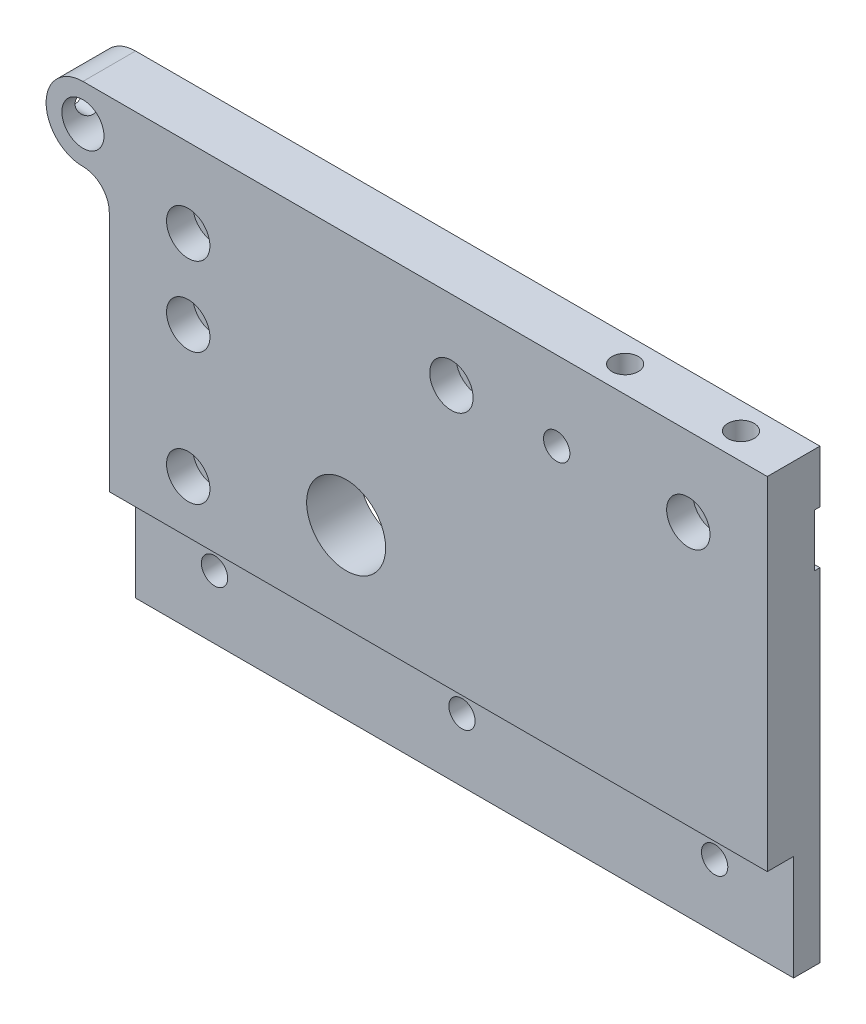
ISO-10303-21;
HEADER;
FILE_DESCRIPTION(('STEP AP214'),'2;1');
FILE_NAME('part.step','',(''),(''),'','','');
FILE_SCHEMA(('AUTOMOTIVE_DESIGN { 1 0 10303 214 1 1 1 1 }'));
ENDSEC;
DATA;
#1=APPLICATION_CONTEXT('core data for automotive mechanical design processes');
#2=APPLICATION_PROTOCOL_DEFINITION('international standard','automotive_design',2000,#1);
#3=PRODUCT_CONTEXT('',#1,'mechanical');
#4=PRODUCT('Part','Part','',(#3));
#5=PRODUCT_RELATED_PRODUCT_CATEGORY('part','',(#4));
#6=PRODUCT_DEFINITION_FORMATION('','',#4);
#7=PRODUCT_DEFINITION_CONTEXT('part definition',#1,'design');
#8=PRODUCT_DEFINITION('design','',#6,#7);
#9=PRODUCT_DEFINITION_SHAPE('','',#8);
#10=(LENGTH_UNIT() NAMED_UNIT(*) SI_UNIT(.MILLI.,.METRE.));
#11=(NAMED_UNIT(*) PLANE_ANGLE_UNIT() SI_UNIT($,.RADIAN.));
#12=(NAMED_UNIT(*) SI_UNIT($,.STERADIAN.) SOLID_ANGLE_UNIT());
#13=UNCERTAINTY_MEASURE_WITH_UNIT(LENGTH_MEASURE(1.E-05),#10,'distance_accuracy_value','');
#14=(GEOMETRIC_REPRESENTATION_CONTEXT(3) GLOBAL_UNCERTAINTY_ASSIGNED_CONTEXT((#13)) GLOBAL_UNIT_ASSIGNED_CONTEXT((#10,
#11,#12)) REPRESENTATION_CONTEXT('',''));
#15=CARTESIAN_POINT('',(0.,0.,0.));
#16=DIRECTION('',(0.,0.,1.));
#17=DIRECTION('',(1.,0.,0.));
#18=AXIS2_PLACEMENT_3D('',#15,#16,#17);
#19=CARTESIAN_POINT('',(60.325,34.925,6.35));
#20=DIRECTION('',(0.,0.,1.));
#21=DIRECTION('',(1.,0.,0.));
#22=AXIS2_PLACEMENT_3D('',#19,#20,#21);
#23=CYLINDRICAL_SURFACE('',#22,3.3782);
#24=CARTESIAN_POINT('',(60.325,34.925,0.));
#25=DIRECTION('',(0.,0.,1.));
#26=DIRECTION('',(1.,0.,0.));
#27=AXIS2_PLACEMENT_3D('',#24,#25,#26);
#28=CIRCLE('',#27,3.37820000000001);
#29=CARTESIAN_POINT('',(63.7032,34.925,0.));
#30=VERTEX_POINT('',#29);
#31=EDGE_CURVE('E219',#30,#30,#28,.T.);
#32=ORIENTED_EDGE('',*,*,#31,.T.);
#33=EDGE_LOOP('',(#32));
#34=FACE_BOUND('',#33,.T.);
#35=CARTESIAN_POINT('',(60.325,34.925,-5.08));
#36=DIRECTION('',(0.,0.,-1.));
#37=DIRECTION('',(-1.,0.,0.));
#38=AXIS2_PLACEMENT_3D('',#35,#36,#37);
#39=CIRCLE('',#38,3.3782);
#40=CARTESIAN_POINT('',(56.9468,34.925,-5.08));
#41=VERTEX_POINT('',#40);
#42=EDGE_CURVE('E165',#41,#41,#39,.F.);
#43=ORIENTED_EDGE('',*,*,#42,.F.);
#44=EDGE_LOOP('',(#43));
#45=FACE_BOUND('',#44,.T.);
#46=ADVANCED_FACE('F35',(#34,#45),#23,.F.);
#47=CARTESIAN_POINT('',(3.175,34.925,6.35));
#48=DIRECTION('',(0.,0.,1.));
#49=DIRECTION('',(1.,0.,0.));
#50=AXIS2_PLACEMENT_3D('',#47,#48,#49);
#51=CYLINDRICAL_SURFACE('',#50,3.3782);
#52=CARTESIAN_POINT('',(3.175,34.925,0.));
#53=DIRECTION('',(0.,0.,1.));
#54=DIRECTION('',(1.,0.,0.));
#55=AXIS2_PLACEMENT_3D('',#52,#53,#54);
#56=CIRCLE('',#55,3.37820000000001);
#57=CARTESIAN_POINT('',(6.55320000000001,34.925,0.));
#58=VERTEX_POINT('',#57);
#59=EDGE_CURVE('E210',#58,#58,#56,.T.);
#60=ORIENTED_EDGE('',*,*,#59,.T.);
#61=EDGE_LOOP('',(#60));
#62=FACE_BOUND('',#61,.T.);
#63=CARTESIAN_POINT('',(3.175,34.925,-5.08));
#64=DIRECTION('',(0.,0.,-1.));
#65=DIRECTION('',(-1.,0.,0.));
#66=AXIS2_PLACEMENT_3D('',#63,#64,#65);
#67=CIRCLE('',#66,3.3782);
#68=CARTESIAN_POINT('',(-0.203200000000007,34.925,-5.08));
#69=VERTEX_POINT('',#68);
#70=EDGE_CURVE('E161',#69,#69,#67,.F.);
#71=ORIENTED_EDGE('',*,*,#70,.F.);
#72=EDGE_LOOP('',(#71));
#73=FACE_BOUND('',#72,.T.);
#74=ADVANCED_FACE('F415',(#62,#73),#51,.F.);
#75=CARTESIAN_POINT('',(-60.325,34.925,6.35));
#76=DIRECTION('',(0.,0.,1.));
#77=DIRECTION('',(1.,0.,0.));
#78=AXIS2_PLACEMENT_3D('',#75,#76,#77);
#79=CYLINDRICAL_SURFACE('',#78,3.3782);
#80=CARTESIAN_POINT('',(-60.325,34.925,0.));
#81=DIRECTION('',(0.,0.,1.));
#82=DIRECTION('',(1.,0.,0.));
#83=AXIS2_PLACEMENT_3D('',#80,#81,#82);
#84=CIRCLE('',#83,3.37820000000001);
#85=CARTESIAN_POINT('',(-56.9468,34.925,0.));
#86=VERTEX_POINT('',#85);
#87=EDGE_CURVE('E201',#86,#86,#84,.T.);
#88=ORIENTED_EDGE('',*,*,#87,.T.);
#89=EDGE_LOOP('',(#88));
#90=FACE_BOUND('',#89,.T.);
#91=CARTESIAN_POINT('',(-60.325,34.925,-5.08));
#92=DIRECTION('',(0.,0.,-1.));
#93=DIRECTION('',(-1.,0.,0.));
#94=AXIS2_PLACEMENT_3D('',#91,#92,#93);
#95=CIRCLE('',#94,3.3782);
#96=CARTESIAN_POINT('',(-63.7032,34.925,-5.08));
#97=VERTEX_POINT('',#96);
#98=EDGE_CURVE('E158',#97,#97,#95,.F.);
#99=ORIENTED_EDGE('',*,*,#98,.F.);
#100=EDGE_LOOP('',(#99));
#101=FACE_BOUND('',#100,.T.);
#102=ADVANCED_FACE('F379',(#90,#101),#79,.F.);
#103=CARTESIAN_POINT('',(28.575,34.925,-15.748));
#104=DIRECTION('',(0.,0.,1.));
#105=DIRECTION('',(1.,0.,0.));
#106=AXIS2_PLACEMENT_3D('',#103,#104,#105);
#107=CYLINDRICAL_SURFACE('',#106,3.175);
#108=CARTESIAN_POINT('',(28.575,34.925,6.35));
#109=DIRECTION('',(0.,0.,1.));
#110=DIRECTION('',(1.,0.,0.));
#111=AXIS2_PLACEMENT_3D('',#108,#109,#110);
#112=CIRCLE('',#111,3.175);
#113=CARTESIAN_POINT('',(31.75,34.925,6.35));
#114=VERTEX_POINT('',#113);
#115=EDGE_CURVE('E168',#114,#114,#112,.T.);
#116=ORIENTED_EDGE('',*,*,#115,.T.);
#117=EDGE_LOOP('',(#116));
#118=FACE_BOUND('',#117,.T.);
#119=CARTESIAN_POINT('',(28.575,34.925,-5.08));
#120=DIRECTION('',(0.,0.,-1.));
#121=DIRECTION('',(-1.,0.,0.));
#122=AXIS2_PLACEMENT_3D('',#119,#120,#121);
#123=CIRCLE('',#122,3.175);
#124=CARTESIAN_POINT('',(25.4,34.925,-5.08));
#125=VERTEX_POINT('',#124);
#126=EDGE_CURVE('E162',#125,#125,#123,.F.);
#127=ORIENTED_EDGE('',*,*,#126,.F.);
#128=EDGE_LOOP('',(#127));
#129=FACE_BOUND('',#128,.T.);
#130=ADVANCED_FACE('F375',(#118,#129),#107,.F.);
#131=CARTESIAN_POINT('',(-85.7249999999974,29.845,6.35));
#132=DIRECTION('',(0.,0.,1.));
#133=DIRECTION('',(1.,0.,0.));
#134=AXIS2_PLACEMENT_3D('',#131,#132,#133);
#135=PLANE('',#134);
#136=ORIENTED_EDGE('',*,*,#115,.F.);
#137=EDGE_LOOP('',(#136));
#138=FACE_BOUND('',#137,.T.);
#139=CARTESIAN_POINT('',(-60.325,-15.875,6.35));
#140=DIRECTION('',(0.,0.,1.));
#141=DIRECTION('',(1.,0.,0.));
#142=AXIS2_PLACEMENT_3D('',#139,#140,#141);
#143=CIRCLE('',#142,5.2324);
#144=CARTESIAN_POINT('',(-55.0926,-15.875,6.35));
#145=VERTEX_POINT('',#144);
#146=EDGE_CURVE('E171',#145,#145,#143,.T.);
#147=ORIENTED_EDGE('',*,*,#146,.F.);
#148=EDGE_LOOP('',(#147));
#149=FACE_BOUND('',#148,.T.);
#150=CARTESIAN_POINT('',(-60.325,15.875,6.35));
#151=DIRECTION('',(0.,0.,1.));
#152=DIRECTION('',(1.,0.,0.));
#153=AXIS2_PLACEMENT_3D('',#150,#151,#152);
#154=CIRCLE('',#153,5.2324);
#155=CARTESIAN_POINT('',(-55.0926,15.875,6.35));
#156=VERTEX_POINT('',#155);
#157=EDGE_CURVE('E183',#156,#156,#154,.T.);
#158=ORIENTED_EDGE('',*,*,#157,.F.);
#159=EDGE_LOOP('',(#158));
#160=FACE_BOUND('',#159,.T.);
#161=CARTESIAN_POINT('',(-60.325,34.925,6.35));
#162=DIRECTION('',(0.,0.,1.));
#163=DIRECTION('',(1.,0.,0.));
#164=AXIS2_PLACEMENT_3D('',#161,#162,#163);
#165=CIRCLE('',#164,5.2324);
#166=CARTESIAN_POINT('',(-55.0926,34.925,6.35));
#167=VERTEX_POINT('',#166);
#168=EDGE_CURVE('E195',#167,#167,#165,.T.);
#169=ORIENTED_EDGE('',*,*,#168,.F.);
#170=EDGE_LOOP('',(#169));
#171=FACE_BOUND('',#170,.T.);
#172=CARTESIAN_POINT('',(3.175,34.925,6.35));
#173=DIRECTION('',(0.,0.,1.));
#174=DIRECTION('',(1.,0.,0.));
#175=AXIS2_PLACEMENT_3D('',#172,#173,#174);
#176=CIRCLE('',#175,5.23239999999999);
#177=CARTESIAN_POINT('',(8.40739999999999,34.925,6.35));
#178=VERTEX_POINT('',#177);
#179=EDGE_CURVE('E204',#178,#178,#176,.T.);
#180=ORIENTED_EDGE('',*,*,#179,.F.);
#181=EDGE_LOOP('',(#180));
#182=FACE_BOUND('',#181,.T.);
#183=CARTESIAN_POINT('',(60.325,34.925,6.35));
#184=DIRECTION('',(0.,0.,1.));
#185=DIRECTION('',(1.,0.,0.));
#186=AXIS2_PLACEMENT_3D('',#183,#184,#185);
#187=CIRCLE('',#186,5.2324);
#188=CARTESIAN_POINT('',(65.5574,34.925,6.35));
#189=VERTEX_POINT('',#188);
#190=EDGE_CURVE('E213',#189,#189,#187,.T.);
#191=ORIENTED_EDGE('',*,*,#190,.F.);
#192=EDGE_LOOP('',(#191));
#193=FACE_BOUND('',#192,.T.);
#194=CARTESIAN_POINT('',(-85.7250000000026,45.085,6.35));
#195=DIRECTION('',(0.,0.,1.));
#196=DIRECTION('',(1.,0.,0.));
#197=AXIS2_PLACEMENT_3D('',#194,#195,#196);
#198=CIRCLE('',#197,5.08000000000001);
#199=CARTESIAN_POINT('',(-80.6450000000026,45.085,6.35));
#200=VERTEX_POINT('',#199);
#201=EDGE_CURVE('E258',#200,#200,#198,.T.);
#202=ORIENTED_EDGE('',*,*,#201,.F.);
#203=EDGE_LOOP('',(#202));
#204=FACE_BOUND('',#203,.T.);
#205=CARTESIAN_POINT('',(-22.2250000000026,-6.98499999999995,6.35));
#206=DIRECTION('',(0.,0.,1.));
#207=DIRECTION('',(1.,0.,0.));
#208=AXIS2_PLACEMENT_3D('',#205,#206,#207);
#209=CIRCLE('',#208,9.525);
#210=CARTESIAN_POINT('',(-12.7000000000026,-6.98499999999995,6.35));
#211=VERTEX_POINT('',#210);
#212=EDGE_CURVE('E252',#211,#211,#209,.T.);
#213=ORIENTED_EDGE('',*,*,#212,.F.);
#214=EDGE_LOOP('',(#213));
#215=FACE_BOUND('',#214,.T.);
#216=DIRECTION('',(0.,-1.,0.));
#217=VECTOR('',#216,1.);
#218=CARTESIAN_POINT('',(-79.3749999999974,29.845,6.35));
#219=LINE('',#218,#217);
#220=CARTESIAN_POINT('',(-79.3749999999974,29.845,6.35));
#221=VERTEX_POINT('',#220);
#222=CARTESIAN_POINT('',(-79.375,-28.575,6.35));
#223=VERTEX_POINT('',#222);
#224=EDGE_CURVE('E267',#221,#223,#219,.T.);
#225=ORIENTED_EDGE('',*,*,#224,.T.);
#226=DIRECTION('',(1.,0.,0.));
#227=VECTOR('',#226,1.);
#228=CARTESIAN_POINT('',(-85.7249999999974,-28.575,6.35));
#229=LINE('',#228,#227);
#230=CARTESIAN_POINT('',(79.375,-28.575,6.35));
#231=VERTEX_POINT('',#230);
#232=EDGE_CURVE('E239',#223,#231,#229,.T.);
#233=ORIENTED_EDGE('',*,*,#232,.T.);
#234=DIRECTION('',(0.,1.,0.));
#235=VECTOR('',#234,1.);
#236=CARTESIAN_POINT('',(79.375,53.975,6.35));
#237=LINE('',#236,#235);
#238=CARTESIAN_POINT('',(79.375,53.975,6.35));
#239=VERTEX_POINT('',#238);
#240=EDGE_CURVE('E271',#231,#239,#237,.T.);
#241=ORIENTED_EDGE('',*,*,#240,.T.);
#242=DIRECTION('',(-1.,0.,0.));
#243=VECTOR('',#242,1.);
#244=CARTESIAN_POINT('',(-85.7250000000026,53.975,6.35));
#245=LINE('',#244,#243);
#246=CARTESIAN_POINT('',(-85.7250000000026,53.975,6.35));
#247=VERTEX_POINT('',#246);
#248=EDGE_CURVE('E273',#239,#247,#245,.T.);
#249=ORIENTED_EDGE('',*,*,#248,.T.);
#250=CARTESIAN_POINT('',(-85.7250000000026,45.085,6.35));
#251=DIRECTION('',(0.,0.,1.));
#252=DIRECTION('',(1.,0.,0.));
#253=AXIS2_PLACEMENT_3D('',#250,#251,#252);
#254=CIRCLE('',#253,8.88999999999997);
#255=CARTESIAN_POINT('',(-85.7249999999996,36.1950000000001,6.35));
#256=VERTEX_POINT('',#255);
#257=EDGE_CURVE('E275',#247,#256,#254,.T.);
#258=ORIENTED_EDGE('',*,*,#257,.T.);
#259=CARTESIAN_POINT('',(-85.7249999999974,29.845,6.35));
#260=DIRECTION('',(0.,0.,-1.));
#261=DIRECTION('',(1.,0.,0.));
#262=AXIS2_PLACEMENT_3D('',#259,#260,#261);
#263=CIRCLE('',#262,6.34999999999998);
#264=EDGE_CURVE('E264',#256,#221,#263,.T.);
#265=ORIENTED_EDGE('',*,*,#264,.T.);
#266=EDGE_LOOP('',(#225,#233,#241,#249,#258,#265));
#267=FACE_BOUND('',#266,.T.);
#268=ADVANCED_FACE('F378',(#138,#149,#160,#171,#182,#193,#204,#215,#267),#135,.T.);
#269=CARTESIAN_POINT('',(-79.3749999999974,29.845,6.35));
#270=DIRECTION('',(1.,0.,0.));
#271=DIRECTION('',(0.,1.,0.));
#272=AXIS2_PLACEMENT_3D('',#269,#270,#271);
#273=PLANE('',#272);
#274=DIRECTION('',(0.,0.,-1.));
#275=VECTOR('',#274,1.);
#276=CARTESIAN_POINT('',(-79.375,-28.575,12.7));
#277=LINE('',#276,#275);
#278=CARTESIAN_POINT('',(-79.375,-28.575,0.));
#279=VERTEX_POINT('',#278);
#280=EDGE_CURVE('E230',#223,#279,#277,.T.);
#281=ORIENTED_EDGE('',*,*,#280,.F.);
#282=ORIENTED_EDGE('',*,*,#224,.F.);
#283=DIRECTION('',(0.,0.,-1.));
#284=VECTOR('',#283,1.);
#285=CARTESIAN_POINT('',(-79.3749999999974,29.845,6.35));
#286=LINE('',#285,#284);
#287=CARTESIAN_POINT('',(-79.3749999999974,29.845,-6.35));
#288=VERTEX_POINT('',#287);
#289=EDGE_CURVE('E48',#221,#288,#286,.T.);
#290=ORIENTED_EDGE('',*,*,#289,.T.);
#291=DIRECTION('',(0.,-1.,0.));
#292=VECTOR('',#291,1.);
#293=CARTESIAN_POINT('',(-79.3749999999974,29.845,-6.35));
#294=LINE('',#293,#292);
#295=CARTESIAN_POINT('',(-79.375,-53.975,-6.35));
#296=VERTEX_POINT('',#295);
#297=EDGE_CURVE('E280',#288,#296,#294,.T.);
#298=ORIENTED_EDGE('',*,*,#297,.T.);
#299=DIRECTION('',(0.,0.,-1.));
#300=VECTOR('',#299,1.);
#301=CARTESIAN_POINT('',(-79.375,-53.975,6.35));
#302=LINE('',#301,#300);
#303=CARTESIAN_POINT('',(-79.375,-53.975,0.));
#304=VERTEX_POINT('',#303);
#305=EDGE_CURVE('E301',#304,#296,#302,.T.);
#306=ORIENTED_EDGE('',*,*,#305,.F.);
#307=DIRECTION('',(0.,-1.,0.));
#308=VECTOR('',#307,1.);
#309=CARTESIAN_POINT('',(-79.375,-53.975,0.));
#310=LINE('',#309,#308);
#311=EDGE_CURVE('E222',#279,#304,#310,.T.);
#312=ORIENTED_EDGE('',*,*,#311,.F.);
#313=EDGE_LOOP('',(#281,#282,#290,#298,#306,#312));
#314=FACE_BOUND('',#313,.T.);
#315=ADVANCED_FACE('F467',(#314),#273,.F.);
#316=CARTESIAN_POINT('',(79.375,53.975,6.35));
#317=DIRECTION('',(-1.,0.,0.));
#318=DIRECTION('',(0.,0.,1.));
#319=AXIS2_PLACEMENT_3D('',#316,#317,#318);
#320=PLANE('',#319);
#321=DIRECTION('',(0.,-1.,0.));
#322=VECTOR('',#321,1.);
#323=CARTESIAN_POINT('',(79.375,41.275,-5.08));
#324=LINE('',#323,#322);
#325=CARTESIAN_POINT('',(79.375,41.275,-5.08));
#326=VERTEX_POINT('',#325);
#327=CARTESIAN_POINT('',(79.375,28.575,-5.08));
#328=VERTEX_POINT('',#327);
#329=EDGE_CURVE('E136',#326,#328,#324,.T.);
#330=ORIENTED_EDGE('',*,*,#329,.F.);
#331=DIRECTION('',(0.,0.,-1.));
#332=VECTOR('',#331,1.);
#333=CARTESIAN_POINT('',(79.375,41.275,-5.08));
#334=LINE('',#333,#332);
#335=CARTESIAN_POINT('',(79.375,41.275,-6.35));
#336=VERTEX_POINT('',#335);
#337=EDGE_CURVE('E307',#326,#336,#334,.T.);
#338=ORIENTED_EDGE('',*,*,#337,.T.);
#339=DIRECTION('',(0.,1.,0.));
#340=VECTOR('',#339,1.);
#341=CARTESIAN_POINT('',(79.375,53.975,-6.35));
#342=LINE('',#341,#340);
#343=CARTESIAN_POINT('',(79.375,53.975,-6.35));
#344=VERTEX_POINT('',#343);
#345=EDGE_CURVE('E286',#336,#344,#342,.T.);
#346=ORIENTED_EDGE('',*,*,#345,.T.);
#347=DIRECTION('',(0.,0.,-1.));
#348=VECTOR('',#347,1.);
#349=CARTESIAN_POINT('',(79.375,53.975,6.35));
#350=LINE('',#349,#348);
#351=EDGE_CURVE('E296',#239,#344,#350,.T.);
#352=ORIENTED_EDGE('',*,*,#351,.F.);
#353=ORIENTED_EDGE('',*,*,#240,.F.);
#354=DIRECTION('',(0.,0.,1.));
#355=VECTOR('',#354,1.);
#356=CARTESIAN_POINT('',(79.375,-28.575,6.35));
#357=LINE('',#356,#355);
#358=CARTESIAN_POINT('',(79.375,-28.575,0.));
#359=VERTEX_POINT('',#358);
#360=EDGE_CURVE('E11',#359,#231,#357,.T.);
#361=ORIENTED_EDGE('',*,*,#360,.F.);
#362=DIRECTION('',(0.,1.,0.));
#363=VECTOR('',#362,1.);
#364=CARTESIAN_POINT('',(79.375,-53.975,0.));
#365=LINE('',#364,#363);
#366=CARTESIAN_POINT('',(79.375,-53.975,0.));
#367=VERTEX_POINT('',#366);
#368=EDGE_CURVE('E225',#367,#359,#365,.T.);
#369=ORIENTED_EDGE('',*,*,#368,.F.);
#370=DIRECTION('',(0.,0.,-1.));
#371=VECTOR('',#370,1.);
#372=CARTESIAN_POINT('',(79.375,-53.975,6.35));
#373=LINE('',#372,#371);
#374=CARTESIAN_POINT('',(79.375,-53.975,-6.35));
#375=VERTEX_POINT('',#374);
#376=EDGE_CURVE('E299',#367,#375,#373,.T.);
#377=ORIENTED_EDGE('',*,*,#376,.T.);
#378=CARTESIAN_POINT('',(79.375,28.575,-6.35));
#379=VERTEX_POINT('',#378);
#380=EDGE_CURVE('E151',#375,#379,#342,.T.);
#381=ORIENTED_EDGE('',*,*,#380,.T.);
#382=DIRECTION('',(0.,0.,-1.));
#383=VECTOR('',#382,1.);
#384=CARTESIAN_POINT('',(79.375,28.575,-5.08));
#385=LINE('',#384,#383);
#386=EDGE_CURVE('E56',#328,#379,#385,.T.);
#387=ORIENTED_EDGE('',*,*,#386,.F.);
#388=EDGE_LOOP('',(#330,#338,#346,#352,#353,#361,#369,#377,#381,#387));
#389=FACE_BOUND('',#388,.T.);
#390=ADVANCED_FACE('F149',(#389),#320,.F.);
#391=CARTESIAN_POINT('',(-85.7249999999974,29.845,-6.35));
#392=DIRECTION('',(0.,0.,1.));
#393=DIRECTION('',(1.,0.,0.));
#394=AXIS2_PLACEMENT_3D('',#391,#392,#393);
#395=PLANE('',#394);
#396=CARTESIAN_POINT('',(-60.325,-15.875,-6.35));
#397=DIRECTION('',(0.,0.,1.));
#398=DIRECTION('',(1.,0.,0.));
#399=AXIS2_PLACEMENT_3D('',#396,#397,#398);
#400=CIRCLE('',#399,3.3782);
#401=CARTESIAN_POINT('',(-56.9468,-15.875,-6.35));
#402=VERTEX_POINT('',#401);
#403=EDGE_CURVE('E180',#402,#402,#400,.T.);
#404=ORIENTED_EDGE('',*,*,#403,.T.);
#405=EDGE_LOOP('',(#404));
#406=FACE_BOUND('',#405,.T.);
#407=CARTESIAN_POINT('',(-60.325,15.875,-6.35));
#408=DIRECTION('',(0.,0.,1.));
#409=DIRECTION('',(1.,0.,0.));
#410=AXIS2_PLACEMENT_3D('',#407,#408,#409);
#411=CIRCLE('',#410,3.3782);
#412=CARTESIAN_POINT('',(-56.9468,15.875,-6.35));
#413=VERTEX_POINT('',#412);
#414=EDGE_CURVE('E192',#413,#413,#411,.T.);
#415=ORIENTED_EDGE('',*,*,#414,.T.);
#416=EDGE_LOOP('',(#415));
#417=FACE_BOUND('',#416,.T.);
#418=ORIENTED_EDGE('',*,*,#345,.F.);
#419=DIRECTION('',(1.,0.,0.));
#420=VECTOR('',#419,1.);
#421=CARTESIAN_POINT('',(79.375,41.275,-6.35));
#422=LINE('',#421,#420);
#423=CARTESIAN_POINT('',(-78.105,41.275,-6.35));
#424=VERTEX_POINT('',#423);
#425=EDGE_CURVE('E146',#424,#336,#422,.T.);
#426=ORIENTED_EDGE('',*,*,#425,.F.);
#427=DIRECTION('',(0.,1.,0.));
#428=VECTOR('',#427,1.);
#429=CARTESIAN_POINT('',(-78.105,41.275,-6.35));
#430=LINE('',#429,#428);
#431=CARTESIAN_POINT('',(-78.105,28.575,-6.35));
#432=VERTEX_POINT('',#431);
#433=EDGE_CURVE('E313',#432,#424,#430,.T.);
#434=ORIENTED_EDGE('',*,*,#433,.F.);
#435=DIRECTION('',(-1.,0.,0.));
#436=VECTOR('',#435,1.);
#437=CARTESIAN_POINT('',(79.375,28.575,-6.35));
#438=LINE('',#437,#436);
#439=EDGE_CURVE('E316',#379,#432,#438,.T.);
#440=ORIENTED_EDGE('',*,*,#439,.F.);
#441=ORIENTED_EDGE('',*,*,#380,.F.);
#442=DIRECTION('',(1.,0.,0.));
#443=VECTOR('',#442,1.);
#444=CARTESIAN_POINT('',(-79.375,-53.975,-6.35));
#445=LINE('',#444,#443);
#446=EDGE_CURVE('E283',#296,#375,#445,.T.);
#447=ORIENTED_EDGE('',*,*,#446,.F.);
#448=ORIENTED_EDGE('',*,*,#297,.F.);
#449=CARTESIAN_POINT('',(-85.7249999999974,29.845,-6.35));
#450=DIRECTION('',(0.,0.,-1.));
#451=DIRECTION('',(1.,0.,0.));
#452=AXIS2_PLACEMENT_3D('',#449,#450,#451);
#453=CIRCLE('',#452,6.34999999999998);
#454=CARTESIAN_POINT('',(-85.7249999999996,36.1950000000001,-6.35));
#455=VERTEX_POINT('',#454);
#456=EDGE_CURVE('E261',#455,#288,#453,.T.);
#457=ORIENTED_EDGE('',*,*,#456,.F.);
#458=CARTESIAN_POINT('',(-85.7250000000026,45.085,-6.35));
#459=DIRECTION('',(0.,0.,1.));
#460=DIRECTION('',(1.,0.,0.));
#461=AXIS2_PLACEMENT_3D('',#458,#459,#460);
#462=CIRCLE('',#461,8.88999999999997);
#463=CARTESIAN_POINT('',(-85.7250000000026,53.975,-6.35));
#464=VERTEX_POINT('',#463);
#465=EDGE_CURVE('E268',#464,#455,#462,.T.);
#466=ORIENTED_EDGE('',*,*,#465,.F.);
#467=DIRECTION('',(-1.,0.,0.));
#468=VECTOR('',#467,1.);
#469=CARTESIAN_POINT('',(-85.7250000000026,53.975,-6.35));
#470=LINE('',#469,#468);
#471=EDGE_CURVE('E288',#344,#464,#470,.T.);
#472=ORIENTED_EDGE('',*,*,#471,.F.);
#473=EDGE_LOOP('',(#418,#426,#434,#440,#441,#447,#448,#457,#466,#472));
#474=FACE_BOUND('',#473,.T.);
#475=CARTESIAN_POINT('',(-85.7250000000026,45.085,-6.35));
#476=DIRECTION('',(0.,0.,1.));
#477=DIRECTION('',(1.,0.,0.));
#478=AXIS2_PLACEMENT_3D('',#475,#476,#477);
#479=CIRCLE('',#478,5.08000000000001);
#480=CARTESIAN_POINT('',(-80.6450000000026,45.085,-6.35));
#481=VERTEX_POINT('',#480);
#482=EDGE_CURVE('E255',#481,#481,#479,.T.);
#483=ORIENTED_EDGE('',*,*,#482,.T.);
#484=EDGE_LOOP('',(#483));
#485=FACE_BOUND('',#484,.T.);
#486=CARTESIAN_POINT('',(-22.2250000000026,-6.98499999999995,-6.35));
#487=DIRECTION('',(0.,0.,1.));
#488=DIRECTION('',(1.,0.,0.));
#489=AXIS2_PLACEMENT_3D('',#486,#487,#488);
#490=CIRCLE('',#489,9.525);
#491=CARTESIAN_POINT('',(-12.7000000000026,-6.98499999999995,-6.35));
#492=VERTEX_POINT('',#491);
#493=EDGE_CURVE('E251',#492,#492,#490,.T.);
#494=ORIENTED_EDGE('',*,*,#493,.T.);
#495=EDGE_LOOP('',(#494));
#496=FACE_BOUND('',#495,.T.);
#497=CARTESIAN_POINT('',(-60.3250000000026,-38.735,-6.35));
#498=DIRECTION('',(0.,0.,1.));
#499=DIRECTION('',(1.,0.,0.));
#500=AXIS2_PLACEMENT_3D('',#497,#498,#499);
#501=CIRCLE('',#500,3.175);
#502=CARTESIAN_POINT('',(-57.1500000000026,-38.735,-6.35));
#503=VERTEX_POINT('',#502);
#504=EDGE_CURVE('E248',#503,#503,#501,.T.);
#505=ORIENTED_EDGE('',*,*,#504,.T.);
#506=EDGE_LOOP('',(#505));
#507=FACE_BOUND('',#506,.T.);
#508=CARTESIAN_POINT('',(-0.634999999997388,-38.735,-6.35));
#509=DIRECTION('',(0.,0.,1.));
#510=DIRECTION('',(1.,0.,0.));
#511=AXIS2_PLACEMENT_3D('',#508,#509,#510);
#512=CIRCLE('',#511,3.175);
#513=CARTESIAN_POINT('',(2.54000000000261,-38.735,-6.35));
#514=VERTEX_POINT('',#513);
#515=EDGE_CURVE('E245',#514,#514,#512,.T.);
#516=ORIENTED_EDGE('',*,*,#515,.T.);
#517=EDGE_LOOP('',(#516));
#518=FACE_BOUND('',#517,.T.);
#519=CARTESIAN_POINT('',(60.3250000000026,-38.735,-6.35));
#520=DIRECTION('',(0.,0.,1.));
#521=DIRECTION('',(1.,0.,0.));
#522=AXIS2_PLACEMENT_3D('',#519,#520,#521);
#523=CIRCLE('',#522,3.175);
#524=CARTESIAN_POINT('',(63.5000000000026,-38.735,-6.35));
#525=VERTEX_POINT('',#524);
#526=EDGE_CURVE('E242',#525,#525,#523,.T.);
#527=ORIENTED_EDGE('',*,*,#526,.T.);
#528=EDGE_LOOP('',(#527));
#529=FACE_BOUND('',#528,.T.);
#530=ADVANCED_FACE('F469',(#406,#417,#474,#485,#496,#507,#518,#529),#395,.F.);
#531=CARTESIAN_POINT('',(-85.7249999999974,29.845,6.35));
#532=DIRECTION('',(0.,0.,-1.));
#533=DIRECTION('',(-1.,0.,0.));
#534=AXIS2_PLACEMENT_3D('',#531,#532,#533);
#535=CYLINDRICAL_SURFACE('',#534,6.34999999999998);
#536=ORIENTED_EDGE('',*,*,#456,.T.);
#537=ORIENTED_EDGE('',*,*,#289,.F.);
#538=ORIENTED_EDGE('',*,*,#264,.F.);
#539=DIRECTION('',(0.,0.,-1.));
#540=VECTOR('',#539,1.);
#541=CARTESIAN_POINT('',(-85.7249999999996,36.1950000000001,6.35));
#542=LINE('',#541,#540);
#543=EDGE_CURVE('E277',#256,#455,#542,.T.);
#544=ORIENTED_EDGE('',*,*,#543,.T.);
#545=EDGE_LOOP('',(#536,#537,#538,#544));
#546=FACE_BOUND('',#545,.T.);
#547=ADVANCED_FACE('F37',(#546),#535,.F.);
#548=CARTESIAN_POINT('',(-79.375,-53.975,6.35));
#549=DIRECTION('',(0.,1.,0.));
#550=DIRECTION('',(-1.,0.,0.));
#551=AXIS2_PLACEMENT_3D('',#548,#549,#550);
#552=PLANE('',#551);
#553=ORIENTED_EDGE('',*,*,#376,.F.);
#554=DIRECTION('',(1.,0.,0.));
#555=VECTOR('',#554,1.);
#556=CARTESIAN_POINT('',(-79.375,-53.975,0.));
#557=LINE('',#556,#555);
#558=EDGE_CURVE('E64',#304,#367,#557,.T.);
#559=ORIENTED_EDGE('',*,*,#558,.F.);
#560=ORIENTED_EDGE('',*,*,#305,.T.);
#561=ORIENTED_EDGE('',*,*,#446,.T.);
#562=EDGE_LOOP('',(#553,#559,#560,#561));
#563=FACE_BOUND('',#562,.T.);
#564=ADVANCED_FACE('F476',(#563),#552,.F.);
#565=CARTESIAN_POINT('',(-85.7250000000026,53.975,6.35));
#566=DIRECTION('',(0.,-1.,0.));
#567=DIRECTION('',(1.,0.,0.));
#568=AXIS2_PLACEMENT_3D('',#565,#566,#567);
#569=PLANE('',#568);
#570=CARTESIAN_POINT('',(38.735,53.975,0.));
#571=DIRECTION('',(0.,1.,0.));
#572=DIRECTION('',(-1.,0.,0.));
#573=AXIS2_PLACEMENT_3D('',#570,#571,#572);
#574=CIRCLE('',#573,3.175);
#575=CARTESIAN_POINT('',(35.56,53.975,0.));
#576=VERTEX_POINT('',#575);
#577=EDGE_CURVE('E326',#576,#576,#574,.T.);
#578=ORIENTED_EDGE('',*,*,#577,.F.);
#579=EDGE_LOOP('',(#578));
#580=FACE_BOUND('',#579,.T.);
#581=CARTESIAN_POINT('',(66.675,53.975,0.));
#582=DIRECTION('',(0.,1.,0.));
#583=DIRECTION('',(-1.,0.,0.));
#584=AXIS2_PLACEMENT_3D('',#581,#582,#583);
#585=CIRCLE('',#584,3.175);
#586=CARTESIAN_POINT('',(63.5,53.975,0.));
#587=VERTEX_POINT('',#586);
#588=EDGE_CURVE('E320',#587,#587,#585,.T.);
#589=ORIENTED_EDGE('',*,*,#588,.F.);
#590=EDGE_LOOP('',(#589));
#591=FACE_BOUND('',#590,.T.);
#592=ORIENTED_EDGE('',*,*,#471,.T.);
#593=DIRECTION('',(0.,0.,-1.));
#594=VECTOR('',#593,1.);
#595=CARTESIAN_POINT('',(-85.7250000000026,53.975,6.35));
#596=LINE('',#595,#594);
#597=EDGE_CURVE('E293',#247,#464,#596,.T.);
#598=ORIENTED_EDGE('',*,*,#597,.F.);
#599=ORIENTED_EDGE('',*,*,#248,.F.);
#600=ORIENTED_EDGE('',*,*,#351,.T.);
#601=EDGE_LOOP('',(#592,#598,#599,#600));
#602=FACE_BOUND('',#601,.T.);
#603=ADVANCED_FACE('F506',(#580,#591,#602),#569,.F.);
#604=CARTESIAN_POINT('',(-85.7250000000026,45.085,6.35));
#605=DIRECTION('',(0.,0.,-1.));
#606=DIRECTION('',(-1.,0.,0.));
#607=AXIS2_PLACEMENT_3D('',#604,#605,#606);
#608=CYLINDRICAL_SURFACE('',#607,8.88999999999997);
#609=CARTESIAN_POINT('',(-94.6150000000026,45.085,3.175));
#610=CARTESIAN_POINT('',(-94.615002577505,44.9124835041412,3.17500358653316));
#611=CARTESIAN_POINT('',(-94.6099334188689,44.7399925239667,3.16089441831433));
#612=CARTESIAN_POINT('',(-94.59021474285,44.4001335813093,3.10503406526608));
#613=CARTESIAN_POINT('',(-94.575565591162,44.2327654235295,3.06328393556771));
#614=CARTESIAN_POINT('',(-94.538267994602,43.9081010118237,2.95378487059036));
#615=CARTESIAN_POINT('',(-94.5156340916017,43.7507870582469,2.88608317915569));
#616=CARTESIAN_POINT('',(-94.4646456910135,43.4497532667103,2.72683132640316));
#617=CARTESIAN_POINT('',(-94.4362898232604,43.3060366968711,2.6352754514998));
#618=CARTESIAN_POINT('',(-94.3755716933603,43.0306632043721,2.42716922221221));
#619=CARTESIAN_POINT('',(-94.3431035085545,42.8996092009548,2.30985221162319));
#620=CARTESIAN_POINT('',(-94.2783677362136,42.6585608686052,2.05518211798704));
#621=CARTESIAN_POINT('',(-94.2461002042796,42.5485721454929,1.91782371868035));
#622=CARTESIAN_POINT('',(-94.1842168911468,42.3491185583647,1.62128480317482));
#623=CARTESIAN_POINT('',(-94.1547279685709,42.2604751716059,1.46152267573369));
#624=CARTESIAN_POINT('',(-94.1033722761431,42.1115798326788,1.12813634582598));
#625=CARTESIAN_POINT('',(-94.081502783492,42.0513177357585,0.954517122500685));
#626=CARTESIAN_POINT('',(-94.0489868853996,41.9632240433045,0.60525299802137));
#627=CARTESIAN_POINT('',(-94.0379467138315,41.9342504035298,0.429933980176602));
#628=CARTESIAN_POINT('',(-94.0271812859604,41.9059848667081,0.0766017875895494));
#629=CARTESIAN_POINT('',(-94.0274518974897,41.9066821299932,-0.101410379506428));
#630=CARTESIAN_POINT('',(-94.0389354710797,41.9368594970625,-0.444951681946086));
#631=CARTESIAN_POINT('',(-94.0495625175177,41.9647984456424,-0.610639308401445));
#632=CARTESIAN_POINT('',(-94.079594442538,42.0461331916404,-0.934798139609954));
#633=CARTESIAN_POINT('',(-94.0990005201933,42.0995324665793,-1.09326835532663));
#634=CARTESIAN_POINT('',(-94.144784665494,42.2311885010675,-1.40179265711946));
#635=CARTESIAN_POINT('',(-94.1712803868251,42.3098697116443,-1.55164739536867));
#636=CARTESIAN_POINT('',(-94.2282147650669,42.4895610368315,-1.83649161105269));
#637=CARTESIAN_POINT('',(-94.258654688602,42.5905783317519,-1.97147628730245));
#638=CARTESIAN_POINT('',(-94.3222967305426,42.8192800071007,-2.23133868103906));
#639=CARTESIAN_POINT('',(-94.355554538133,42.9482080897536,-2.35511068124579));
#640=CARTESIAN_POINT('',(-94.4194895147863,43.2253874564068,-2.57958803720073));
#641=CARTESIAN_POINT('',(-94.450166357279,43.373641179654,-2.68029047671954));
#642=CARTESIAN_POINT('',(-94.5059958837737,43.6878725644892,-2.85684037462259));
#643=CARTESIAN_POINT('',(-94.5310724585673,43.8540536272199,-2.93235156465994));
#644=CARTESIAN_POINT('',(-94.5723174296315,44.1978751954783,-3.05398909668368));
#645=CARTESIAN_POINT('',(-94.588489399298,44.3755110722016,-3.10012722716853));
#646=CARTESIAN_POINT('',(-94.6094907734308,44.7278695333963,-3.15965732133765));
#647=CARTESIAN_POINT('',(-94.6148362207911,44.9023097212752,-3.17454042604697));
#648=CARTESIAN_POINT('',(-94.6151561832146,45.2512549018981,-3.17543830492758));
#649=CARTESIAN_POINT('',(-94.6101327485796,45.42575987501,-3.16145878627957));
#650=CARTESIAN_POINT('',(-94.5906204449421,45.7636482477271,-3.10618360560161));
#651=CARTESIAN_POINT('',(-94.5764608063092,45.9272079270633,-3.06583746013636));
#652=CARTESIAN_POINT('',(-94.5404287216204,46.245144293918,-2.96019652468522));
#653=CARTESIAN_POINT('',(-94.5185552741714,46.3995197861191,-2.89489849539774));
#654=CARTESIAN_POINT('',(-94.4685148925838,46.699573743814,-2.73918825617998));
#655=CARTESIAN_POINT('',(-94.4401878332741,46.8448840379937,-2.64811956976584));
#656=CARTESIAN_POINT('',(-94.3804106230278,47.1186247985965,-2.44420708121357));
#657=CARTESIAN_POINT('',(-94.3489594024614,47.2470494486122,-2.33135580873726));
#658=CARTESIAN_POINT('',(-94.2843687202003,47.4904091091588,-2.08009536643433));
#659=CARTESIAN_POINT('',(-94.2512272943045,47.6042822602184,-1.94065561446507));
#660=CARTESIAN_POINT('',(-94.1886340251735,47.8071881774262,-1.64396258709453));
#661=CARTESIAN_POINT('',(-94.1591823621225,47.8962197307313,-1.48670844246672));
#662=CARTESIAN_POINT('',(-94.1075122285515,48.0467503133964,-1.15815769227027));
#663=CARTESIAN_POINT('',(-94.0853015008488,48.1082198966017,-0.986846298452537));
#664=CARTESIAN_POINT('',(-94.0511383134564,48.2010900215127,-0.635304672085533));
#665=CARTESIAN_POINT('',(-94.0391802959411,48.23250685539,-0.455079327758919));
#666=CARTESIAN_POINT('',(-94.0275690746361,48.2630004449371,-0.10220899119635));
#667=CARTESIAN_POINT('',(-94.0272351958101,48.2638662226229,0.0702604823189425));
#668=CARTESIAN_POINT('',(-94.0371921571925,48.2377373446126,0.412747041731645));
#669=CARTESIAN_POINT('',(-94.0474821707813,48.2107448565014,0.582764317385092));
#670=CARTESIAN_POINT('',(-94.0769860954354,48.1310061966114,0.911225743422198));
#671=CARTESIAN_POINT('',(-94.0959697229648,48.0789229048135,1.06985320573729));
#672=CARTESIAN_POINT('',(-94.1406083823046,47.9510425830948,1.37622620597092));
#673=CARTESIAN_POINT('',(-94.1662650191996,47.8752398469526,1.52396911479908));
#674=CARTESIAN_POINT('',(-94.2229158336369,47.6977749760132,1.81219570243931));
#675=CARTESIAN_POINT('',(-94.2541091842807,47.5950327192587,1.95197481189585));
#676=CARTESIAN_POINT('',(-94.3175712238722,47.3683439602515,2.2128829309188));
#677=CARTESIAN_POINT('',(-94.3498402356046,47.2443910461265,2.33400627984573));
#678=CARTESIAN_POINT('',(-94.4136471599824,46.971791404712,2.559966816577));
#679=CARTESIAN_POINT('',(-94.4450786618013,46.8222552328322,2.66376536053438));
#680=CARTESIAN_POINT('',(-94.502032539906,46.5067793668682,2.84468273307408));
#681=CARTESIAN_POINT('',(-94.5275553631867,46.3408409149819,2.9218035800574));
#682=CARTESIAN_POINT('',(-94.5698642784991,45.9964108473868,3.04690819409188));
#683=CARTESIAN_POINT('',(-94.586613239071,45.8178694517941,3.09476826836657));
#684=CARTESIAN_POINT('',(-94.609177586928,45.4545406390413,3.15880607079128));
#685=CARTESIAN_POINT('',(-94.6149972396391,45.2697556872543,3.17499615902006));
#686=CARTESIAN_POINT('',(-94.6150000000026,45.085,3.175));
#687=B_SPLINE_CURVE_WITH_KNOTS('',3,(#609,#610,#611,#612,#613,#614,#615,#616,#617,#618,#619,
#620,#621,#622,#623,#624,#625,#626,#627,#628,#629,#630,#631,#632,#633,#634,#635,#636,#637,#638,
#639,#640,#641,#642,#643,#644,#645,#646,#647,#648,#649,#650,#651,#652,#653,#654,#655,#656,#657,
#658,#659,#660,#661,#662,#663,#664,#665,#666,#667,#668,#669,#670,#671,#672,#673,#674,#675,#676,
#677,#678,#679,#680,#681,#682,#683,#684,#685,#686),.UNSPECIFIED.,.T.,.F.,(4,2,2,2,2,2,2,2,2,2,2,
2,2,2,2,2,2,2,2,2,2,2,2,2,2,2,2,2,2,2,2,2,2,2,2,2,2,2,4),(0.,0.516868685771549,1.03371764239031,
1.54963012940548,2.06566630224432,2.59987507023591,3.13422580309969,3.68667800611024,
4.23893258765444,4.7702668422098,5.30140698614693,5.80414443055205,6.30695056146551,
6.81868270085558,7.33057958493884,7.87344949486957,8.41638799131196,8.96630826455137,
9.51600769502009,10.0388233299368,10.5615355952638,11.0663904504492,11.5713108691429,
12.090474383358,12.6098162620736,13.1564174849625,13.7030453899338,14.2502559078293,
14.7971696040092,15.3120002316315,15.8267908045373,16.3286704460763,16.8306709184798,
17.3571337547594,17.8837560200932,18.4352366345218,18.9866755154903,19.5404296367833,
20.0939675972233),.UNSPECIFIED.);
#688=CARTESIAN_POINT('',(-94.6150000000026,45.085,3.175));
#689=VERTEX_POINT('',#688);
#690=EDGE_CURVE('E329',#689,#689,#687,.T.);
#691=ORIENTED_EDGE('',*,*,#690,.T.);
#692=EDGE_LOOP('',(#691));
#693=FACE_BOUND('',#692,.T.);
#694=ORIENTED_EDGE('',*,*,#465,.T.);
#695=ORIENTED_EDGE('',*,*,#543,.F.);
#696=ORIENTED_EDGE('',*,*,#257,.F.);
#697=ORIENTED_EDGE('',*,*,#597,.T.);
#698=EDGE_LOOP('',(#694,#695,#696,#697));
#699=FACE_BOUND('',#698,.T.);
#700=ADVANCED_FACE('F336',(#693,#699),#608,.T.);
#701=CARTESIAN_POINT('',(-85.7250000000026,45.085,6.35));
#702=DIRECTION('',(0.,0.,-1.));
#703=DIRECTION('',(-1.,0.,0.));
#704=AXIS2_PLACEMENT_3D('',#701,#702,#703);
#705=CYLINDRICAL_SURFACE('',#704,5.08000000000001);
#706=CARTESIAN_POINT('',(-90.8050000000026,45.085,3.175));
#707=CARTESIAN_POINT('',(-90.8049993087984,45.0043029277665,3.17499919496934));
#708=CARTESIAN_POINT('',(-90.8030709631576,44.9235989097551,3.17191702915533));
#709=CARTESIAN_POINT('',(-90.7954145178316,44.7628284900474,3.15964340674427));
#710=CARTESIAN_POINT('',(-90.7896847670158,44.6827623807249,3.15044929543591));
#711=CARTESIAN_POINT('',(-90.7669496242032,44.4442504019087,3.11382126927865));
#712=CARTESIAN_POINT('',(-90.7443986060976,44.2876036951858,3.0773418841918));
#713=CARTESIAN_POINT('',(-90.686786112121,43.9846209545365,2.98243934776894));
#714=CARTESIAN_POINT('',(-90.6517865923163,43.8382380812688,2.92412479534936));
#715=CARTESIAN_POINT('',(-90.5721984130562,43.5578085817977,2.78793988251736));
#716=CARTESIAN_POINT('',(-90.5276108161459,43.4237605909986,2.7100716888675));
#717=CARTESIAN_POINT('',(-90.4283220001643,43.1597425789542,2.53012812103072));
#718=CARTESIAN_POINT('',(-90.3730974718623,43.0309531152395,2.42661618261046));
#719=CARTESIAN_POINT('',(-90.259696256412,42.791415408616,2.20162329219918));
#720=CARTESIAN_POINT('',(-90.2015156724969,42.680691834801,2.08011819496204));
#721=CARTESIAN_POINT('',(-90.0793326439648,42.4651707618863,1.80331391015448));
#722=CARTESIAN_POINT('',(-90.0156089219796,42.3632068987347,1.64566654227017));
#723=CARTESIAN_POINT('',(-89.8989870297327,42.1875213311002,1.31174536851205));
#724=CARTESIAN_POINT('',(-89.8460706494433,42.1137519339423,1.13550366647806));
#725=CARTESIAN_POINT('',(-89.7714632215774,42.0132916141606,0.815821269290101));
#726=CARTESIAN_POINT('',(-89.7452334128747,41.9793533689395,0.675724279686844));
#727=CARTESIAN_POINT('',(-89.7072464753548,41.9307811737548,0.390382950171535));
#728=CARTESIAN_POINT('',(-89.6954689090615,41.916119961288,0.245146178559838));
#729=CARTESIAN_POINT('',(-89.6881591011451,41.9069794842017,-0.0467690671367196));
#730=CARTESIAN_POINT('',(-89.692669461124,41.9125531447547,-0.193450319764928));
#731=CARTESIAN_POINT('',(-89.7173060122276,41.9436215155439,-0.483387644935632));
#732=CARTESIAN_POINT('',(-89.7374447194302,41.9691321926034,-0.626640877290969));
#733=CARTESIAN_POINT('',(-89.7898273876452,42.0378102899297,-0.902813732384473));
#734=CARTESIAN_POINT('',(-89.8217842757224,42.0805610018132,-1.03589466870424));
#735=CARTESIAN_POINT('',(-89.8942972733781,42.1820287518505,-1.2932691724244));
#736=CARTESIAN_POINT('',(-89.9348564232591,42.2407514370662,-1.41755961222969));
#737=CARTESIAN_POINT('',(-90.0291528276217,42.3851116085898,-1.67851753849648));
#738=CARTESIAN_POINT('',(-90.0839364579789,42.4737277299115,-1.81315980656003));
#739=CARTESIAN_POINT('',(-90.1955430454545,42.6697534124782,-2.06712475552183));
#740=CARTESIAN_POINT('',(-90.252368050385,42.7771822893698,-2.18643147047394));
#741=CARTESIAN_POINT('',(-90.3726982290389,43.0288534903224,-2.42648461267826));
#742=CARTESIAN_POINT('',(-90.4357586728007,43.1762452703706,-2.54422079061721));
#743=CARTESIAN_POINT('',(-90.522743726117,43.413119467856,-2.70081997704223));
#744=CARTESIAN_POINT('',(-90.5504832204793,43.4947538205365,-2.74970514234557));
#745=CARTESIAN_POINT('',(-90.6026755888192,43.6628867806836,-2.84030298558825));
#746=CARTESIAN_POINT('',(-90.6271304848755,43.7493823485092,-2.88202008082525));
#747=CARTESIAN_POINT('',(-90.6708266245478,43.9219451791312,-2.95571596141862));
#748=CARTESIAN_POINT('',(-90.6902766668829,44.0077882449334,-2.98809606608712));
#749=CARTESIAN_POINT('',(-90.7250160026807,44.1826809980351,-3.04547319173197));
#750=CARTESIAN_POINT('',(-90.7403076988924,44.2717287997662,-3.07047447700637));
#751=CARTESIAN_POINT('',(-90.7662608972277,44.4522324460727,-3.11268587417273));
#752=CARTESIAN_POINT('',(-90.7769265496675,44.5436860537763,-3.12990297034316));
#753=CARTESIAN_POINT('',(-90.7932988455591,44.7281836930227,-3.15626136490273));
#754=CARTESIAN_POINT('',(-90.7990063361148,44.821227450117,-3.16540404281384));
#755=CARTESIAN_POINT('',(-90.8048081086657,44.9940285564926,-3.17469443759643));
#756=CARTESIAN_POINT('',(-90.8056110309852,45.0737036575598,-3.17597779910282));
#757=CARTESIAN_POINT('',(-90.8034705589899,45.2329025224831,-3.17255264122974));
#758=CARTESIAN_POINT('',(-90.8005259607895,45.3124262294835,-3.16784219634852));
#759=CARTESIAN_POINT('',(-90.7909606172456,45.4706398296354,-3.15249402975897));
#760=CARTESIAN_POINT('',(-90.7843415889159,45.5493300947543,-3.14185907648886));
#761=CARTESIAN_POINT('',(-90.7675931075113,45.7053428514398,-3.11481612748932));
#762=CARTESIAN_POINT('',(-90.7574623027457,45.7826648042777,-3.09840590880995));
#763=CARTESIAN_POINT('',(-90.7230636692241,46.0057083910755,-3.04232446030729));
#764=CARTESIAN_POINT('',(-90.6943626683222,46.1489423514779,-2.99513990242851));
#765=CARTESIAN_POINT('',(-90.6270896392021,46.4252268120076,-2.88214439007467));
#766=CARTESIAN_POINT('',(-90.5885159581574,46.5582756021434,-2.8163303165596));
#767=CARTESIAN_POINT('',(-90.499946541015,46.8251056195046,-2.66061223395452));
#768=CARTESIAN_POINT('',(-90.4491908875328,46.9576051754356,-2.56894716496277));
#769=CARTESIAN_POINT('',(-90.3428969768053,47.2062644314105,-2.36780335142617));
#770=CARTESIAN_POINT('',(-90.2873534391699,47.3224057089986,-2.2583048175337));
#771=CARTESIAN_POINT('',(-90.1676091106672,47.5525437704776,-2.00625707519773));
#772=CARTESIAN_POINT('',(-90.103322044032,47.6637818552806,-1.86121751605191));
#773=CARTESIAN_POINT('',(-89.9811957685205,47.8607211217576,-1.552255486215));
#774=CARTESIAN_POINT('',(-89.9233521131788,47.9464399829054,-1.38834619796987));
#775=CARTESIAN_POINT('',(-89.8330316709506,48.0741931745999,-1.08028194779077));
#776=CARTESIAN_POINT('',(-89.7977791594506,48.1216181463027,-0.939188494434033));
#777=CARTESIAN_POINT('',(-89.7408677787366,48.19650275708,-0.649241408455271));
#778=CARTESIAN_POINT('',(-89.7191876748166,48.2239935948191,-0.500400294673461));
#779=CARTESIAN_POINT('',(-89.6926406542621,48.2574951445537,-0.197890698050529));
#780=CARTESIAN_POINT('',(-89.6878699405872,48.2633829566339,-0.0441995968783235));
#781=CARTESIAN_POINT('',(-89.6962662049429,48.2528823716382,0.261952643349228));
#782=CARTESIAN_POINT('',(-89.7094391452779,48.2364865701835,0.414413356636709));
#783=CARTESIAN_POINT('',(-89.7497668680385,48.1847721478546,0.701115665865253));
#784=CARTESIAN_POINT('',(-89.7757109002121,48.1510828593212,0.835835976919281));
#785=CARTESIAN_POINT('',(-89.8377052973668,48.0674075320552,1.09762310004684));
#786=CARTESIAN_POINT('',(-89.8737598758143,48.0174146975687,1.22468669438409));
#787=CARTESIAN_POINT('',(-89.9582630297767,47.8943087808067,1.48741552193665));
#788=CARTESIAN_POINT('',(-90.0077502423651,47.8188963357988,1.6216629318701));
#789=CARTESIAN_POINT('',(-90.1107601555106,47.650398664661,1.87690427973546));
#790=CARTESIAN_POINT('',(-90.164286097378,47.5572991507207,1.99788737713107));
#791=CARTESIAN_POINT('',(-90.2818066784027,47.3346103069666,2.24793249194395));
#792=CARTESIAN_POINT('',(-90.3457742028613,47.201445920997,2.37384559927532));
#793=CARTESIAN_POINT('',(-90.4671552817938,46.9133166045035,2.60223202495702));
#794=CARTESIAN_POINT('',(-90.5245647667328,46.7583382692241,2.70469082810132));
#795=CARTESIAN_POINT('',(-90.6012820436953,46.5117987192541,2.83789559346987));
#796=CARTESIAN_POINT('',(-90.6253183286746,46.4271308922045,2.87893104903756));
#797=CARTESIAN_POINT('',(-90.6695566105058,46.253653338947,2.95360378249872));
#798=CARTESIAN_POINT('',(-90.6897608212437,46.1648460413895,2.98724533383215));
#799=CARTESIAN_POINT('',(-90.7256678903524,45.9839997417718,3.0465486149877));
#800=CARTESIAN_POINT('',(-90.7413828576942,45.8919701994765,3.07223182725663));
#801=CARTESIAN_POINT('',(-90.7678609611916,45.705339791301,3.1152786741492));
#802=CARTESIAN_POINT('',(-90.7786277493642,45.6107408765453,3.13264844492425));
#803=CARTESIAN_POINT('',(-90.7927864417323,45.4442244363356,3.15543025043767));
#804=CARTESIAN_POINT('',(-90.7973579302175,45.3726622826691,3.16276055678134));
#805=CARTESIAN_POINT('',(-90.8034651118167,45.2290686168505,3.17254594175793));
#806=CARTESIAN_POINT('',(-90.8050006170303,45.1570370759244,3.17500071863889));
#807=CARTESIAN_POINT('',(-90.8050000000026,45.085,3.175));
#808=B_SPLINE_CURVE_WITH_KNOTS('',3,(#706,#707,#708,#709,#710,#711,#712,#713,#714,#715,#716,
#717,#718,#719,#720,#721,#722,#723,#724,#725,#726,#727,#728,#729,#730,#731,#732,#733,#734,#735,
#736,#737,#738,#739,#740,#741,#742,#743,#744,#745,#746,#747,#748,#749,#750,#751,#752,#753,#754,
#755,#756,#757,#758,#759,#760,#761,#762,#763,#764,#765,#766,#767,#768,#769,#770,#771,#772,#773,
#774,#775,#776,#777,#778,#779,#780,#781,#782,#783,#784,#785,#786,#787,#788,#789,#790,#791,#792,
#793,#794,#795,#796,#797,#798,#799,#800,#801,#802,#803,#804,#805,#806,#807),.UNSPECIFIED.,.T.,
.F.,(4,2,2,2,2,2,2,2,2,2,2,2,2,2,2,2,2,2,2,2,2,2,2,2,2,2,2,2,2,2,2,2,2,2,2,2,2,2,2,2,2,2,2,2,2,
2,2,2,2,2,4),(0.,0.242012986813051,0.484131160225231,0.96870116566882,1.45089246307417,
1.93303035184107,2.45367146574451,2.97501767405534,3.56697350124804,4.15792351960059,
4.59564894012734,5.03275464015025,5.47100443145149,5.90960556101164,6.33818623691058,
6.76691863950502,7.2757411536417,7.78508918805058,8.37847530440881,8.67546834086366,
8.97227769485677,9.25322324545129,9.53400611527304,9.81453655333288,10.0950190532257,
10.3337824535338,10.5726225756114,10.8113511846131,11.0501717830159,11.5086105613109,
11.967126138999,12.471924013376,12.9772859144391,13.5560081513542,14.1343285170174,
14.5914196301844,15.0477938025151,15.5067603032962,15.9658793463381,16.3880436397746,
16.8103841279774,17.2938674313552,17.7777429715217,18.3574928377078,18.9376005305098,
19.228560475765,19.5193518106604,19.8093512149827,20.0991362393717,20.3151642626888,
20.5312056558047),.UNSPECIFIED.);
#809=CARTESIAN_POINT('',(-90.8050000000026,45.085,3.175));
#810=VERTEX_POINT('',#809);
#811=EDGE_CURVE('E39',#810,#810,#808,.T.);
#812=ORIENTED_EDGE('',*,*,#811,.F.);
#813=EDGE_LOOP('',(#812));
#814=FACE_BOUND('',#813,.T.);
#815=ORIENTED_EDGE('',*,*,#201,.T.);
#816=EDGE_LOOP('',(#815));
#817=FACE_BOUND('',#816,.T.);
#818=ORIENTED_EDGE('',*,*,#482,.F.);
#819=EDGE_LOOP('',(#818));
#820=FACE_BOUND('',#819,.T.);
#821=ADVANCED_FACE('F460',(#814,#817,#820),#705,.F.);
#822=CARTESIAN_POINT('',(-22.2250000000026,-6.98499999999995,6.35));
#823=DIRECTION('',(0.,0.,-1.));
#824=DIRECTION('',(-1.,0.,0.));
#825=AXIS2_PLACEMENT_3D('',#822,#823,#824);
#826=CYLINDRICAL_SURFACE('',#825,9.525);
#827=ORIENTED_EDGE('',*,*,#212,.T.);
#828=EDGE_LOOP('',(#827));
#829=FACE_BOUND('',#828,.T.);
#830=ORIENTED_EDGE('',*,*,#493,.F.);
#831=EDGE_LOOP('',(#830));
#832=FACE_BOUND('',#831,.T.);
#833=ADVANCED_FACE('F457',(#829,#832),#826,.F.);
#834=CARTESIAN_POINT('',(-60.3250000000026,-38.735,6.35));
#835=DIRECTION('',(0.,0.,-1.));
#836=DIRECTION('',(-1.,0.,0.));
#837=AXIS2_PLACEMENT_3D('',#834,#835,#836);
#838=CYLINDRICAL_SURFACE('',#837,3.175);
#839=CARTESIAN_POINT('',(-60.3250000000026,-38.735,0.));
#840=DIRECTION('',(0.,0.,-1.));
#841=DIRECTION('',(-1.,0.,0.));
#842=AXIS2_PLACEMENT_3D('',#839,#840,#841);
#843=CIRCLE('',#842,3.175);
#844=CARTESIAN_POINT('',(-63.5000000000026,-38.735,0.));
#845=VERTEX_POINT('',#844);
#846=EDGE_CURVE('E236',#845,#845,#843,.T.);
#847=ORIENTED_EDGE('',*,*,#846,.F.);
#848=EDGE_LOOP('',(#847));
#849=FACE_BOUND('',#848,.T.);
#850=ORIENTED_EDGE('',*,*,#504,.F.);
#851=EDGE_LOOP('',(#850));
#852=FACE_BOUND('',#851,.T.);
#853=ADVANCED_FACE('F453',(#849,#852),#838,.F.);
#854=CARTESIAN_POINT('',(-0.634999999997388,-38.735,6.35));
#855=DIRECTION('',(0.,0.,-1.));
#856=DIRECTION('',(-1.,0.,0.));
#857=AXIS2_PLACEMENT_3D('',#854,#855,#856);
#858=CYLINDRICAL_SURFACE('',#857,3.175);
#859=CARTESIAN_POINT('',(-0.634999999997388,-38.735,0.));
#860=DIRECTION('',(0.,0.,-1.));
#861=DIRECTION('',(-1.,0.,0.));
#862=AXIS2_PLACEMENT_3D('',#859,#860,#861);
#863=CIRCLE('',#862,3.175);
#864=CARTESIAN_POINT('',(-3.80999999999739,-38.735,0.));
#865=VERTEX_POINT('',#864);
#866=EDGE_CURVE('E233',#865,#865,#863,.T.);
#867=ORIENTED_EDGE('',*,*,#866,.F.);
#868=EDGE_LOOP('',(#867));
#869=FACE_BOUND('',#868,.T.);
#870=ORIENTED_EDGE('',*,*,#515,.F.);
#871=EDGE_LOOP('',(#870));
#872=FACE_BOUND('',#871,.T.);
#873=ADVANCED_FACE('F449',(#869,#872),#858,.F.);
#874=CARTESIAN_POINT('',(60.3250000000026,-38.735,6.35));
#875=DIRECTION('',(0.,0.,-1.));
#876=DIRECTION('',(-1.,0.,0.));
#877=AXIS2_PLACEMENT_3D('',#874,#875,#876);
#878=CYLINDRICAL_SURFACE('',#877,3.175);
#879=CARTESIAN_POINT('',(60.3250000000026,-38.735,0.));
#880=DIRECTION('',(0.,0.,-1.));
#881=DIRECTION('',(-1.,0.,0.));
#882=AXIS2_PLACEMENT_3D('',#879,#880,#881);
#883=CIRCLE('',#882,3.175);
#884=CARTESIAN_POINT('',(57.1500000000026,-38.735,0.));
#885=VERTEX_POINT('',#884);
#886=EDGE_CURVE('E232',#885,#885,#883,.T.);
#887=ORIENTED_EDGE('',*,*,#886,.F.);
#888=EDGE_LOOP('',(#887));
#889=FACE_BOUND('',#888,.T.);
#890=ORIENTED_EDGE('',*,*,#526,.F.);
#891=EDGE_LOOP('',(#890));
#892=FACE_BOUND('',#891,.T.);
#893=ADVANCED_FACE('F445',(#889,#892),#878,.F.);
#894=CARTESIAN_POINT('',(-79.375,-28.575,12.7));
#895=DIRECTION('',(0.,-1.,0.));
#896=DIRECTION('',(0.,0.,-1.));
#897=AXIS2_PLACEMENT_3D('',#894,#895,#896);
#898=PLANE('',#897);
#899=ORIENTED_EDGE('',*,*,#280,.T.);
#900=DIRECTION('',(-1.,0.,0.));
#901=VECTOR('',#900,1.);
#902=CARTESIAN_POINT('',(-79.375,-28.575,0.));
#903=LINE('',#902,#901);
#904=EDGE_CURVE('E227',#359,#279,#903,.T.);
#905=ORIENTED_EDGE('',*,*,#904,.F.);
#906=ORIENTED_EDGE('',*,*,#360,.T.);
#907=ORIENTED_EDGE('',*,*,#232,.F.);
#908=EDGE_LOOP('',(#899,#905,#906,#907));
#909=FACE_BOUND('',#908,.T.);
#910=ADVANCED_FACE('F441',(#909),#898,.T.);
#911=CARTESIAN_POINT('',(0.,0.,0.));
#912=DIRECTION('',(0.,0.,-1.));
#913=DIRECTION('',(-1.,0.,0.));
#914=AXIS2_PLACEMENT_3D('',#911,#912,#913);
#915=PLANE('',#914);
#916=ORIENTED_EDGE('',*,*,#846,.T.);
#917=EDGE_LOOP('',(#916));
#918=FACE_BOUND('',#917,.T.);
#919=ORIENTED_EDGE('',*,*,#866,.T.);
#920=EDGE_LOOP('',(#919));
#921=FACE_BOUND('',#920,.T.);
#922=ORIENTED_EDGE('',*,*,#886,.T.);
#923=EDGE_LOOP('',(#922));
#924=FACE_BOUND('',#923,.T.);
#925=ORIENTED_EDGE('',*,*,#311,.T.);
#926=ORIENTED_EDGE('',*,*,#558,.T.);
#927=ORIENTED_EDGE('',*,*,#368,.T.);
#928=ORIENTED_EDGE('',*,*,#904,.T.);
#929=EDGE_LOOP('',(#925,#926,#927,#928));
#930=FACE_BOUND('',#929,.T.);
#931=ADVANCED_FACE('F434',(#918,#921,#924,#930),#915,.F.);
#932=CARTESIAN_POINT('',(63.7032,34.925,0.));
#933=DIRECTION('',(0.,0.,-1.));
#934=DIRECTION('',(-1.,0.,0.));
#935=AXIS2_PLACEMENT_3D('',#932,#933,#934);
#936=PLANE('',#935);
#937=ORIENTED_EDGE('',*,*,#31,.F.);
#938=EDGE_LOOP('',(#937));
#939=FACE_BOUND('',#938,.T.);
#940=CARTESIAN_POINT('',(60.325,34.925,0.));
#941=DIRECTION('',(0.,0.,1.));
#942=DIRECTION('',(1.,0.,0.));
#943=AXIS2_PLACEMENT_3D('',#940,#941,#942);
#944=CIRCLE('',#943,5.2324);
#945=CARTESIAN_POINT('',(65.5574,34.925,0.));
#946=VERTEX_POINT('',#945);
#947=EDGE_CURVE('E216',#946,#946,#944,.T.);
#948=ORIENTED_EDGE('',*,*,#947,.T.);
#949=EDGE_LOOP('',(#948));
#950=FACE_BOUND('',#949,.T.);
#951=ADVANCED_FACE('F430',(#939,#950),#936,.F.);
#952=CARTESIAN_POINT('',(60.325,34.925,6.35));
#953=DIRECTION('',(0.,0.,1.));
#954=DIRECTION('',(1.,0.,0.));
#955=AXIS2_PLACEMENT_3D('',#952,#953,#954);
#956=CYLINDRICAL_SURFACE('',#955,5.2324);
#957=ORIENTED_EDGE('',*,*,#947,.F.);
#958=EDGE_LOOP('',(#957));
#959=FACE_BOUND('',#958,.T.);
#960=ORIENTED_EDGE('',*,*,#190,.T.);
#961=EDGE_LOOP('',(#960));
#962=FACE_BOUND('',#961,.T.);
#963=ADVANCED_FACE('F423',(#959,#962),#956,.F.);
#964=CARTESIAN_POINT('',(6.55320000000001,34.925,0.));
#965=DIRECTION('',(0.,0.,-1.));
#966=DIRECTION('',(-1.,0.,0.));
#967=AXIS2_PLACEMENT_3D('',#964,#965,#966);
#968=PLANE('',#967);
#969=ORIENTED_EDGE('',*,*,#59,.F.);
#970=EDGE_LOOP('',(#969));
#971=FACE_BOUND('',#970,.T.);
#972=CARTESIAN_POINT('',(3.175,34.925,0.));
#973=DIRECTION('',(0.,0.,1.));
#974=DIRECTION('',(1.,0.,0.));
#975=AXIS2_PLACEMENT_3D('',#972,#973,#974);
#976=CIRCLE('',#975,5.23239999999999);
#977=CARTESIAN_POINT('',(8.40739999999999,34.925,0.));
#978=VERTEX_POINT('',#977);
#979=EDGE_CURVE('E207',#978,#978,#976,.T.);
#980=ORIENTED_EDGE('',*,*,#979,.T.);
#981=EDGE_LOOP('',(#980));
#982=FACE_BOUND('',#981,.T.);
#983=ADVANCED_FACE('F419',(#971,#982),#968,.F.);
#984=CARTESIAN_POINT('',(3.175,34.925,6.35));
#985=DIRECTION('',(0.,0.,1.));
#986=DIRECTION('',(1.,0.,0.));
#987=AXIS2_PLACEMENT_3D('',#984,#985,#986);
#988=CYLINDRICAL_SURFACE('',#987,5.23239999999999);
#989=ORIENTED_EDGE('',*,*,#979,.F.);
#990=EDGE_LOOP('',(#989));
#991=FACE_BOUND('',#990,.T.);
#992=ORIENTED_EDGE('',*,*,#179,.T.);
#993=EDGE_LOOP('',(#992));
#994=FACE_BOUND('',#993,.T.);
#995=ADVANCED_FACE('F411',(#991,#994),#988,.F.);
#996=CARTESIAN_POINT('',(-56.9468,34.925,0.));
#997=DIRECTION('',(0.,0.,-1.));
#998=DIRECTION('',(-1.,0.,0.));
#999=AXIS2_PLACEMENT_3D('',#996,#997,#998);
#1000=PLANE('',#999);
#1001=ORIENTED_EDGE('',*,*,#87,.F.);
#1002=EDGE_LOOP('',(#1001));
#1003=FACE_BOUND('',#1002,.T.);
#1004=CARTESIAN_POINT('',(-60.325,34.925,0.));
#1005=DIRECTION('',(0.,0.,1.));
#1006=DIRECTION('',(1.,0.,0.));
#1007=AXIS2_PLACEMENT_3D('',#1004,#1005,#1006);
#1008=CIRCLE('',#1007,5.2324);
#1009=CARTESIAN_POINT('',(-55.0926,34.925,0.));
#1010=VERTEX_POINT('',#1009);
#1011=EDGE_CURVE('E198',#1010,#1010,#1008,.T.);
#1012=ORIENTED_EDGE('',*,*,#1011,.T.);
#1013=EDGE_LOOP('',(#1012));
#1014=FACE_BOUND('',#1013,.T.);
#1015=ADVANCED_FACE('F407',(#1003,#1014),#1000,.F.);
#1016=CARTESIAN_POINT('',(-60.325,34.925,6.35));
#1017=DIRECTION('',(0.,0.,1.));
#1018=DIRECTION('',(1.,0.,0.));
#1019=AXIS2_PLACEMENT_3D('',#1016,#1017,#1018);
#1020=CYLINDRICAL_SURFACE('',#1019,5.2324);
#1021=ORIENTED_EDGE('',*,*,#1011,.F.);
#1022=EDGE_LOOP('',(#1021));
#1023=FACE_BOUND('',#1022,.T.);
#1024=ORIENTED_EDGE('',*,*,#168,.T.);
#1025=EDGE_LOOP('',(#1024));
#1026=FACE_BOUND('',#1025,.T.);
#1027=ADVANCED_FACE('F403',(#1023,#1026),#1020,.F.);
#1028=CARTESIAN_POINT('',(-60.325,15.875,6.35));
#1029=DIRECTION('',(0.,0.,1.));
#1030=DIRECTION('',(1.,0.,0.));
#1031=AXIS2_PLACEMENT_3D('',#1028,#1029,#1030);
#1032=CYLINDRICAL_SURFACE('',#1031,3.3782);
#1033=ORIENTED_EDGE('',*,*,#414,.F.);
#1034=EDGE_LOOP('',(#1033));
#1035=FACE_BOUND('',#1034,.T.);
#1036=CARTESIAN_POINT('',(-60.325,15.875,0.));
#1037=DIRECTION('',(0.,0.,1.));
#1038=DIRECTION('',(1.,0.,0.));
#1039=AXIS2_PLACEMENT_3D('',#1036,#1037,#1038);
#1040=CIRCLE('',#1039,3.37820000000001);
#1041=CARTESIAN_POINT('',(-56.9468,15.875,0.));
#1042=VERTEX_POINT('',#1041);
#1043=EDGE_CURVE('E189',#1042,#1042,#1040,.T.);
#1044=ORIENTED_EDGE('',*,*,#1043,.T.);
#1045=EDGE_LOOP('',(#1044));
#1046=FACE_BOUND('',#1045,.T.);
#1047=ADVANCED_FACE('F399',(#1035,#1046),#1032,.F.);
#1048=CARTESIAN_POINT('',(-56.9468,15.875,0.));
#1049=DIRECTION('',(0.,0.,-1.));
#1050=DIRECTION('',(-1.,0.,0.));
#1051=AXIS2_PLACEMENT_3D('',#1048,#1049,#1050);
#1052=PLANE('',#1051);
#1053=ORIENTED_EDGE('',*,*,#1043,.F.);
#1054=EDGE_LOOP('',(#1053));
#1055=FACE_BOUND('',#1054,.T.);
#1056=CARTESIAN_POINT('',(-60.325,15.875,0.));
#1057=DIRECTION('',(0.,0.,1.));
#1058=DIRECTION('',(1.,0.,0.));
#1059=AXIS2_PLACEMENT_3D('',#1056,#1057,#1058);
#1060=CIRCLE('',#1059,5.2324);
#1061=CARTESIAN_POINT('',(-55.0926,15.875,0.));
#1062=VERTEX_POINT('',#1061);
#1063=EDGE_CURVE('E186',#1062,#1062,#1060,.T.);
#1064=ORIENTED_EDGE('',*,*,#1063,.T.);
#1065=EDGE_LOOP('',(#1064));
#1066=FACE_BOUND('',#1065,.T.);
#1067=ADVANCED_FACE('F395',(#1055,#1066),#1052,.F.);
#1068=CARTESIAN_POINT('',(-60.325,15.875,6.35));
#1069=DIRECTION('',(0.,0.,1.));
#1070=DIRECTION('',(1.,0.,0.));
#1071=AXIS2_PLACEMENT_3D('',#1068,#1069,#1070);
#1072=CYLINDRICAL_SURFACE('',#1071,5.2324);
#1073=ORIENTED_EDGE('',*,*,#1063,.F.);
#1074=EDGE_LOOP('',(#1073));
#1075=FACE_BOUND('',#1074,.T.);
#1076=ORIENTED_EDGE('',*,*,#157,.T.);
#1077=EDGE_LOOP('',(#1076));
#1078=FACE_BOUND('',#1077,.T.);
#1079=ADVANCED_FACE('F391',(#1075,#1078),#1072,.F.);
#1080=CARTESIAN_POINT('',(-60.325,-15.875,6.35));
#1081=DIRECTION('',(0.,0.,1.));
#1082=DIRECTION('',(1.,0.,0.));
#1083=AXIS2_PLACEMENT_3D('',#1080,#1081,#1082);
#1084=CYLINDRICAL_SURFACE('',#1083,3.3782);
#1085=ORIENTED_EDGE('',*,*,#403,.F.);
#1086=EDGE_LOOP('',(#1085));
#1087=FACE_BOUND('',#1086,.T.);
#1088=CARTESIAN_POINT('',(-60.325,-15.875,0.));
#1089=DIRECTION('',(0.,0.,1.));
#1090=DIRECTION('',(1.,0.,0.));
#1091=AXIS2_PLACEMENT_3D('',#1088,#1089,#1090);
#1092=CIRCLE('',#1091,3.37820000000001);
#1093=CARTESIAN_POINT('',(-56.9468,-15.875,0.));
#1094=VERTEX_POINT('',#1093);
#1095=EDGE_CURVE('E177',#1094,#1094,#1092,.T.);
#1096=ORIENTED_EDGE('',*,*,#1095,.T.);
#1097=EDGE_LOOP('',(#1096));
#1098=FACE_BOUND('',#1097,.T.);
#1099=ADVANCED_FACE('F387',(#1087,#1098),#1084,.F.);
#1100=CARTESIAN_POINT('',(-56.9468,-15.875,0.));
#1101=DIRECTION('',(0.,0.,-1.));
#1102=DIRECTION('',(-1.,0.,0.));
#1103=AXIS2_PLACEMENT_3D('',#1100,#1101,#1102);
#1104=PLANE('',#1103);
#1105=ORIENTED_EDGE('',*,*,#1095,.F.);
#1106=EDGE_LOOP('',(#1105));
#1107=FACE_BOUND('',#1106,.T.);
#1108=CARTESIAN_POINT('',(-60.325,-15.875,0.));
#1109=DIRECTION('',(0.,0.,1.));
#1110=DIRECTION('',(1.,0.,0.));
#1111=AXIS2_PLACEMENT_3D('',#1108,#1109,#1110);
#1112=CIRCLE('',#1111,5.2324);
#1113=CARTESIAN_POINT('',(-55.0926,-15.875,0.));
#1114=VERTEX_POINT('',#1113);
#1115=EDGE_CURVE('E174',#1114,#1114,#1112,.T.);
#1116=ORIENTED_EDGE('',*,*,#1115,.T.);
#1117=EDGE_LOOP('',(#1116));
#1118=FACE_BOUND('',#1117,.T.);
#1119=ADVANCED_FACE('F383',(#1107,#1118),#1104,.F.);
#1120=CARTESIAN_POINT('',(-60.325,-15.875,6.35));
#1121=DIRECTION('',(0.,0.,1.));
#1122=DIRECTION('',(1.,0.,0.));
#1123=AXIS2_PLACEMENT_3D('',#1120,#1121,#1122);
#1124=CYLINDRICAL_SURFACE('',#1123,5.2324);
#1125=ORIENTED_EDGE('',*,*,#1115,.F.);
#1126=EDGE_LOOP('',(#1125));
#1127=FACE_BOUND('',#1126,.T.);
#1128=ORIENTED_EDGE('',*,*,#146,.T.);
#1129=EDGE_LOOP('',(#1128));
#1130=FACE_BOUND('',#1129,.T.);
#1131=ADVANCED_FACE('F365',(#1127,#1130),#1124,.F.);
#1132=CARTESIAN_POINT('',(0.,0.,-5.08));
#1133=DIRECTION('',(0.,0.,-1.));
#1134=DIRECTION('',(-1.,0.,0.));
#1135=AXIS2_PLACEMENT_3D('',#1132,#1133,#1134);
#1136=PLANE('',#1135);
#1137=ORIENTED_EDGE('',*,*,#329,.T.);
#1138=DIRECTION('',(-1.,0.,0.));
#1139=VECTOR('',#1138,1.);
#1140=CARTESIAN_POINT('',(79.375,28.575,-5.08));
#1141=LINE('',#1140,#1139);
#1142=CARTESIAN_POINT('',(-78.105,28.575,-5.08));
#1143=VERTEX_POINT('',#1142);
#1144=EDGE_CURVE('E128',#328,#1143,#1141,.T.);
#1145=ORIENTED_EDGE('',*,*,#1144,.T.);
#1146=DIRECTION('',(0.,1.,0.));
#1147=VECTOR('',#1146,1.);
#1148=CARTESIAN_POINT('',(-78.105,41.275,-5.08));
#1149=LINE('',#1148,#1147);
#1150=CARTESIAN_POINT('',(-78.105,41.275,-5.08));
#1151=VERTEX_POINT('',#1150);
#1152=EDGE_CURVE('E135',#1143,#1151,#1149,.T.);
#1153=ORIENTED_EDGE('',*,*,#1152,.T.);
#1154=DIRECTION('',(1.,0.,0.));
#1155=VECTOR('',#1154,1.);
#1156=CARTESIAN_POINT('',(79.375,41.275,-5.08));
#1157=LINE('',#1156,#1155);
#1158=EDGE_CURVE('E143',#1151,#326,#1157,.T.);
#1159=ORIENTED_EDGE('',*,*,#1158,.T.);
#1160=EDGE_LOOP('',(#1137,#1145,#1153,#1159));
#1161=FACE_BOUND('',#1160,.T.);
#1162=ORIENTED_EDGE('',*,*,#126,.T.);
#1163=EDGE_LOOP('',(#1162));
#1164=FACE_BOUND('',#1163,.T.);
#1165=ORIENTED_EDGE('',*,*,#98,.T.);
#1166=EDGE_LOOP('',(#1165));
#1167=FACE_BOUND('',#1166,.T.);
#1168=ORIENTED_EDGE('',*,*,#70,.T.);
#1169=EDGE_LOOP('',(#1168));
#1170=FACE_BOUND('',#1169,.T.);
#1171=ORIENTED_EDGE('',*,*,#42,.T.);
#1172=EDGE_LOOP('',(#1171));
#1173=FACE_BOUND('',#1172,.T.);
#1174=ADVANCED_FACE('F140',(#1161,#1164,#1167,#1170,#1173),#1136,.T.);
#1175=CARTESIAN_POINT('',(79.375,41.275,-5.08));
#1176=DIRECTION('',(0.,1.,0.));
#1177=DIRECTION('',(0.,0.,1.));
#1178=AXIS2_PLACEMENT_3D('',#1175,#1176,#1177);
#1179=PLANE('',#1178);
#1180=ORIENTED_EDGE('',*,*,#425,.T.);
#1181=ORIENTED_EDGE('',*,*,#337,.F.);
#1182=ORIENTED_EDGE('',*,*,#1158,.F.);
#1183=DIRECTION('',(0.,0.,-1.));
#1184=VECTOR('',#1183,1.);
#1185=CARTESIAN_POINT('',(-78.105,41.275,-5.08));
#1186=LINE('',#1185,#1184);
#1187=EDGE_CURVE('E153',#1151,#424,#1186,.T.);
#1188=ORIENTED_EDGE('',*,*,#1187,.T.);
#1189=EDGE_LOOP('',(#1180,#1181,#1182,#1188));
#1190=FACE_BOUND('',#1189,.T.);
#1191=ADVANCED_FACE('F364',(#1190),#1179,.F.);
#1192=CARTESIAN_POINT('',(-78.105,41.275,-5.08));
#1193=DIRECTION('',(-1.,0.,0.));
#1194=DIRECTION('',(0.,0.,1.));
#1195=AXIS2_PLACEMENT_3D('',#1192,#1193,#1194);
#1196=PLANE('',#1195);
#1197=ORIENTED_EDGE('',*,*,#433,.T.);
#1198=ORIENTED_EDGE('',*,*,#1187,.F.);
#1199=ORIENTED_EDGE('',*,*,#1152,.F.);
#1200=DIRECTION('',(0.,0.,-1.));
#1201=VECTOR('',#1200,1.);
#1202=CARTESIAN_POINT('',(-78.105,28.575,-5.08));
#1203=LINE('',#1202,#1201);
#1204=EDGE_CURVE('E131',#1143,#432,#1203,.T.);
#1205=ORIENTED_EDGE('',*,*,#1204,.T.);
#1206=EDGE_LOOP('',(#1197,#1198,#1199,#1205));
#1207=FACE_BOUND('',#1206,.T.);
#1208=ADVANCED_FACE('F368',(#1207),#1196,.F.);
#1209=CARTESIAN_POINT('',(79.375,28.575,-5.08));
#1210=DIRECTION('',(0.,-1.,0.));
#1211=DIRECTION('',(0.,0.,-1.));
#1212=AXIS2_PLACEMENT_3D('',#1209,#1210,#1211);
#1213=PLANE('',#1212);
#1214=ORIENTED_EDGE('',*,*,#439,.T.);
#1215=ORIENTED_EDGE('',*,*,#1204,.F.);
#1216=ORIENTED_EDGE('',*,*,#1144,.F.);
#1217=ORIENTED_EDGE('',*,*,#386,.T.);
#1218=EDGE_LOOP('',(#1214,#1215,#1216,#1217));
#1219=FACE_BOUND('',#1218,.T.);
#1220=ADVANCED_FACE('F130',(#1219),#1213,.F.);
#1221=CARTESIAN_POINT('',(66.675,41.275,0.));
#1222=DIRECTION('',(0.,1.,0.));
#1223=DIRECTION('',(-1.,0.,0.));
#1224=AXIS2_PLACEMENT_3D('',#1221,#1222,#1223);
#1225=CYLINDRICAL_SURFACE('',#1224,3.175);
#1226=CARTESIAN_POINT('',(66.675,41.275,0.));
#1227=DIRECTION('',(0.,1.,0.));
#1228=DIRECTION('',(-1.,0.,0.));
#1229=AXIS2_PLACEMENT_3D('',#1226,#1227,#1228);
#1230=CIRCLE('',#1229,3.175);
#1231=CARTESIAN_POINT('',(63.5,41.275,0.));
#1232=VERTEX_POINT('',#1231);
#1233=EDGE_CURVE('E317',#1232,#1232,#1230,.T.);
#1234=ORIENTED_EDGE('',*,*,#1233,.F.);
#1235=EDGE_LOOP('',(#1234));
#1236=FACE_BOUND('',#1235,.T.);
#1237=ORIENTED_EDGE('',*,*,#588,.T.);
#1238=EDGE_LOOP('',(#1237));
#1239=FACE_BOUND('',#1238,.T.);
#1240=ADVANCED_FACE('F357',(#1236,#1239),#1225,.F.);
#1241=CARTESIAN_POINT('',(66.675,41.275,0.));
#1242=DIRECTION('',(0.,1.,0.));
#1243=DIRECTION('',(-1.,0.,0.));
#1244=AXIS2_PLACEMENT_3D('',#1241,#1242,#1243);
#1245=PLANE('',#1244);
#1246=ORIENTED_EDGE('',*,*,#1233,.T.);
#1247=EDGE_LOOP('',(#1246));
#1248=FACE_BOUND('',#1247,.T.);
#1249=ADVANCED_FACE('F353',(#1248),#1245,.T.);
#1250=CARTESIAN_POINT('',(38.735,41.275,0.));
#1251=DIRECTION('',(0.,1.,0.));
#1252=DIRECTION('',(-1.,0.,0.));
#1253=AXIS2_PLACEMENT_3D('',#1250,#1251,#1252);
#1254=CYLINDRICAL_SURFACE('',#1253,3.175);
#1255=CARTESIAN_POINT('',(38.735,41.275,0.));
#1256=DIRECTION('',(0.,1.,0.));
#1257=DIRECTION('',(-1.,0.,0.));
#1258=AXIS2_PLACEMENT_3D('',#1255,#1256,#1257);
#1259=CIRCLE('',#1258,3.175);
#1260=CARTESIAN_POINT('',(35.56,41.275,0.));
#1261=VERTEX_POINT('',#1260);
#1262=EDGE_CURVE('E323',#1261,#1261,#1259,.T.);
#1263=ORIENTED_EDGE('',*,*,#1262,.F.);
#1264=EDGE_LOOP('',(#1263));
#1265=FACE_BOUND('',#1264,.T.);
#1266=ORIENTED_EDGE('',*,*,#577,.T.);
#1267=EDGE_LOOP('',(#1266));
#1268=FACE_BOUND('',#1267,.T.);
#1269=ADVANCED_FACE('F349',(#1265,#1268),#1254,.F.);
#1270=CARTESIAN_POINT('',(38.735,41.275,0.));
#1271=DIRECTION('',(0.,1.,0.));
#1272=DIRECTION('',(-1.,0.,0.));
#1273=AXIS2_PLACEMENT_3D('',#1270,#1271,#1272);
#1274=PLANE('',#1273);
#1275=ORIENTED_EDGE('',*,*,#1262,.T.);
#1276=EDGE_LOOP('',(#1275));
#1277=FACE_BOUND('',#1276,.T.);
#1278=ADVANCED_FACE('F344',(#1277),#1274,.T.);
#1279=CARTESIAN_POINT('',(-85.7250000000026,45.085,0.));
#1280=DIRECTION('',(-1.,0.,0.));
#1281=DIRECTION('',(0.,0.,1.));
#1282=AXIS2_PLACEMENT_3D('',#1279,#1280,#1281);
#1283=CYLINDRICAL_SURFACE('',#1282,3.175);
#1284=ORIENTED_EDGE('',*,*,#811,.T.);
#1285=EDGE_LOOP('',(#1284));
#1286=FACE_BOUND('',#1285,.T.);
#1287=ORIENTED_EDGE('',*,*,#690,.F.);
#1288=EDGE_LOOP('',(#1287));
#1289=FACE_BOUND('',#1288,.T.);
#1290=ADVANCED_FACE('F340',(#1286,#1289),#1283,.F.);
#1291=CLOSED_SHELL('',(#46,#74,#102,#130,#268,#315,#390,#530,#547,#564,#603,#700,#821,#833,#853,
#873,#893,#910,#931,#951,#963,#983,#995,#1015,#1027,#1047,#1067,#1079,#1099,#1119,#1131,#1174,
#1191,#1208,#1220,#1240,#1249,#1269,#1278,#1290));
#1292=MANIFOLD_SOLID_BREP('B2',#1291);
#1293=ADVANCED_BREP_SHAPE_REPRESENTATION('',(#18,#1292),#14);
#1294=SHAPE_DEFINITION_REPRESENTATION(#9,#1293);
ENDSEC;
END-ISO-10303-21;
